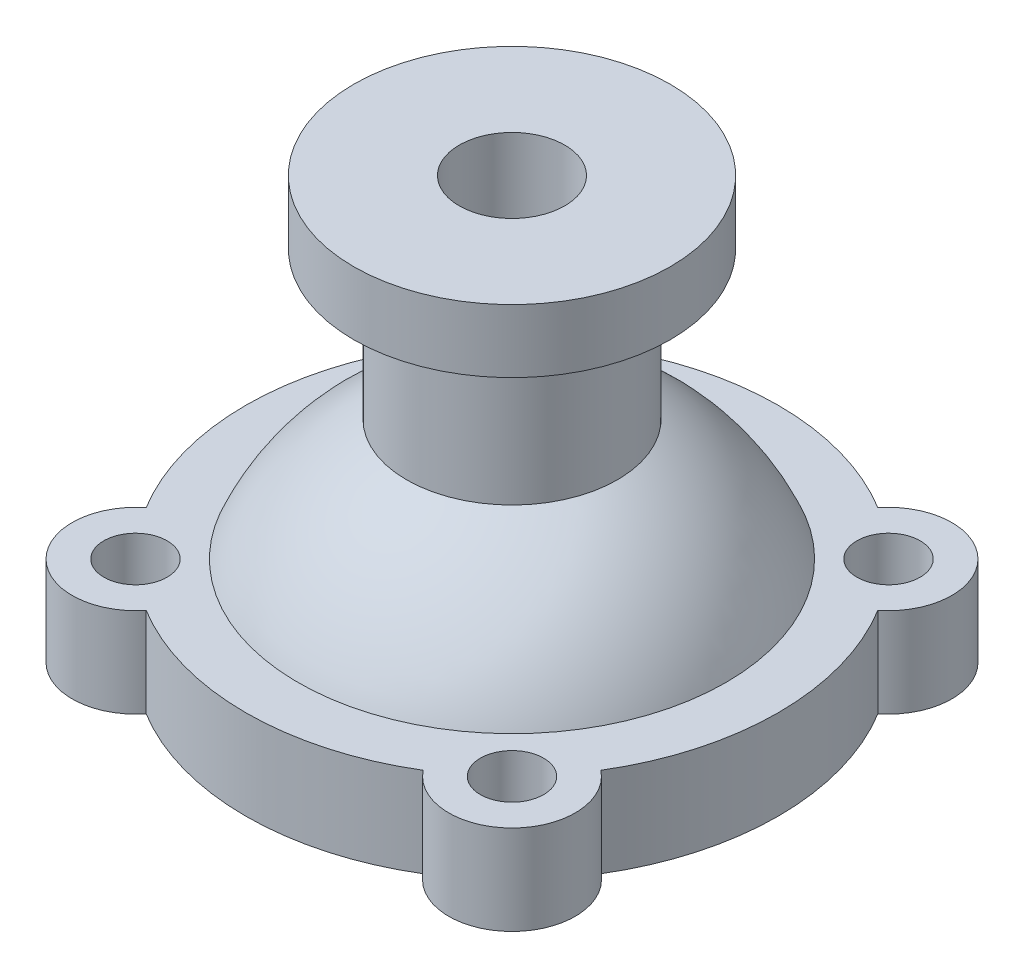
from build123d import *

# Parameters (mm, degrees)
SKETCH_1_R          = 12
EXTRUDE_1_DEPTH     = 34
SKETCH_4_R          = 40
EXTRUDE_2_DEPTH     = 56
SKETCH_5_R          = 60
EXTRUDE_3_DEPTH     = 24
SKETCH_6_R          = 20
CUT_EXTRUDE_1_DEPTH = 215.480768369


with BuildPart() as part:
    # Sketch 1 → Extrude 1 (new body)
    with BuildSketch(Plane(origin=(0, 0, 0), x_dir=(1, 0, 0), z_dir=(0, 1, 0))):
        with BuildLine():
            ThreePointArc((52.551123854, 86.251836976), (0, 101), (-52.551123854, 86.251836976))
            ThreePointArc((-52.551123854, 86.251836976), (-88.388347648, 88.388347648), (-86.251836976, 52.551123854))
            ThreePointArc((-86.251836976, 52.551123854), (-101, 0), (-86.251836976, -52.551123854))
            ThreePointArc((-86.251836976, -52.551123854), (-88.388347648, -88.388347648), (-52.551123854, -86.251836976))
            ThreePointArc((-52.551123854, -86.251836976), (0, -101), (52.551123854, -86.251836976))
            ThreePointArc((52.551123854, -86.251836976), (88.388347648, -88.388347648), (86.251836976, -52.551123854))
            ThreePointArc((86.251836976, -52.551123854), (101, 0), (86.251836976, 52.551123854))
            ThreePointArc((86.251836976, 52.551123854), (88.388347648, 88.388347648), (52.551123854, 86.251836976))
        make_face()
        with Locations(Location((-71.4177849, 71.4177849, 0), (0, 0, 270))):
            Circle(SKETCH_1_R, mode=Mode.SUBTRACT)
        with Locations(Location((71.4177849, 71.4177849, 0), (0, 0, 270))):
            Circle(SKETCH_1_R, mode=Mode.SUBTRACT)
        with Locations(Location((71.4177849, -71.4177849, 0), (0, 0, 270))):
            Circle(SKETCH_1_R, mode=Mode.SUBTRACT)
        with Locations(Location((-71.4177849, -71.4177849, 0), (0, 0, 270))):
            Circle(SKETCH_1_R, mode=Mode.SUBTRACT)
    extrude(amount=EXTRUDE_1_DEPTH)

    # Sketch 2 → Revolve 1 (revolve)
    with BuildSketch(Plane.XY):
        with BuildLine():
            Line((0, 74), (0, 88))
            ThreePointArc((0, 88), (48.744230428, 73.266636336), (81.166495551, 34))
            Line((81.166495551, 34), (65.726706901, 34))
            ThreePointArc((65.726706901, 34), (38.470768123, 63.213922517), (0, 74))
        make_face()
    revolve(axis=Axis((0, 55.316889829, 0), (0, -1, 0)))

    # Sketch 3 → Cut-Revolve 1 (revolve, cut)
    with BuildSketch(Plane.XY):
        with BuildLine():
            Line((0, 74), (0, 0))
            Line((0, 0), (74, 0))
            ThreePointArc((74, 0), (52.325901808, 52.325901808), (0, 74))
        make_face()
    revolve(axis=Axis((0, -8.145541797, 0), (0, -1, 0)), mode=Mode.SUBTRACT)

    # Sketch 4 → Extrude 2 (add)
    with BuildSketch(Plane(origin=(0, 80, 0), x_dir=(-1, 0, 0), z_dir=(0, 1, 0))):
        with Locations(Location((0, 0, 0), (0, 0, 90))):
            Circle(SKETCH_4_R)
    extrude(amount=EXTRUDE_2_DEPTH)

    # Sketch 5 → Extrude 3 (add)
    with BuildSketch(Plane(origin=(0, 136, 0), x_dir=(1, 0, 0), z_dir=(0, 1, 0))):
        with Locations(Location((0, 0, 0), (0, 0, 270))):
            Circle(SKETCH_5_R)
    extrude(amount=EXTRUDE_3_DEPTH)

    # Sketch 6 → Cut-Extrude 1 (cut, through all)
    with BuildSketch(Plane(origin=(0, 160, 0), x_dir=(1, 0, 0), z_dir=(0, 1, 0))):
        with Locations(Location((0, 0, 0), (0, 0, 270))):
            Circle(SKETCH_6_R)
    extrude(amount=-CUT_EXTRUDE_1_DEPTH, mode=Mode.SUBTRACT)


solid = part.part
